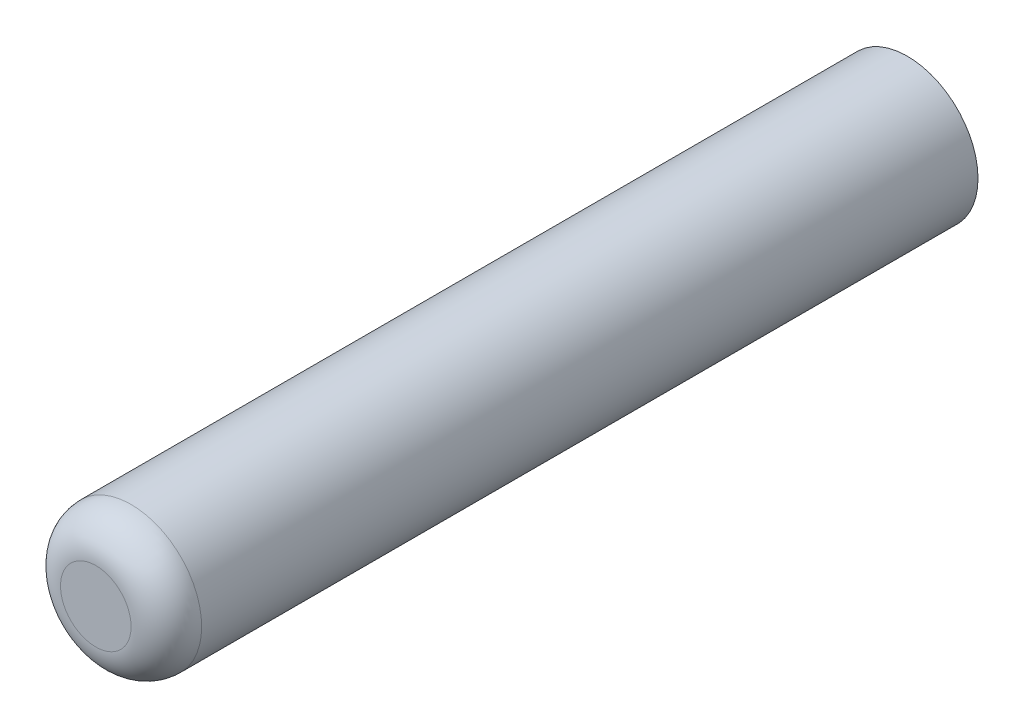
ISO-10303-21;
HEADER;
FILE_DESCRIPTION(('STEP AP214'),'2;1');
FILE_NAME('part.step','',(''),(''),'','','');
FILE_SCHEMA(('AUTOMOTIVE_DESIGN { 1 0 10303 214 1 1 1 1 }'));
ENDSEC;
DATA;
#1=APPLICATION_CONTEXT('core data for automotive mechanical design processes');
#2=APPLICATION_PROTOCOL_DEFINITION('international standard','automotive_design',2000,#1);
#3=PRODUCT_CONTEXT('',#1,'mechanical');
#4=PRODUCT('Part','Part','',(#3));
#5=PRODUCT_RELATED_PRODUCT_CATEGORY('part','',(#4));
#6=PRODUCT_DEFINITION_FORMATION('','',#4);
#7=PRODUCT_DEFINITION_CONTEXT('part definition',#1,'design');
#8=PRODUCT_DEFINITION('design','',#6,#7);
#9=PRODUCT_DEFINITION_SHAPE('','',#8);
#10=(LENGTH_UNIT() NAMED_UNIT(*) SI_UNIT(.MILLI.,.METRE.));
#11=(NAMED_UNIT(*) PLANE_ANGLE_UNIT() SI_UNIT($,.RADIAN.));
#12=(NAMED_UNIT(*) SI_UNIT($,.STERADIAN.) SOLID_ANGLE_UNIT());
#13=UNCERTAINTY_MEASURE_WITH_UNIT(LENGTH_MEASURE(1.E-05),#10,'distance_accuracy_value','');
#14=(GEOMETRIC_REPRESENTATION_CONTEXT(3) GLOBAL_UNCERTAINTY_ASSIGNED_CONTEXT((#13)) GLOBAL_UNIT_ASSIGNED_CONTEXT((#10,
#11,#12)) REPRESENTATION_CONTEXT('',''));
#15=CARTESIAN_POINT('',(0.,0.,0.));
#16=DIRECTION('',(0.,0.,1.));
#17=DIRECTION('',(1.,0.,0.));
#18=AXIS2_PLACEMENT_3D('',#15,#16,#17);
#19=CARTESIAN_POINT('',(0.,0.,5.75000000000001));
#20=DIRECTION('',(0.,0.,-1.));
#21=DIRECTION('',(-1.,0.,0.));
#22=AXIS2_PLACEMENT_3D('',#19,#20,#21);
#23=CYLINDRICAL_SURFACE('',#22,0.999999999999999);
#24=CARTESIAN_POINT('',(0.,0.,5.25));
#25=DIRECTION('',(0.,0.,1.));
#26=DIRECTION('',(1.,0.,0.));
#27=AXIS2_PLACEMENT_3D('',#24,#25,#26);
#28=CIRCLE('',#27,0.999999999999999);
#29=CARTESIAN_POINT('',(0.999999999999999,0.,5.25));
#30=VERTEX_POINT('',#29);
#31=EDGE_CURVE('E10',#30,#30,#28,.F.);
#32=ORIENTED_EDGE('',*,*,#31,.T.);
#33=EDGE_LOOP('',(#32));
#34=FACE_BOUND('',#33,.T.);
#35=CARTESIAN_POINT('',(0.,0.,-5.75000000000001));
#36=DIRECTION('',(0.,0.,1.));
#37=DIRECTION('',(1.,0.,0.));
#38=AXIS2_PLACEMENT_3D('',#35,#36,#37);
#39=CIRCLE('',#38,0.999999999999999);
#40=CARTESIAN_POINT('',(0.999999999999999,0.,-5.75000000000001));
#41=VERTEX_POINT('',#40);
#42=EDGE_CURVE('E39',#41,#41,#39,.T.);
#43=ORIENTED_EDGE('',*,*,#42,.T.);
#44=EDGE_LOOP('',(#43));
#45=FACE_BOUND('',#44,.T.);
#46=ADVANCED_FACE('F29',(#34,#45),#23,.T.);
#47=CARTESIAN_POINT('',(0.,0.,5.75000000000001));
#48=DIRECTION('',(0.,0.,1.));
#49=DIRECTION('',(1.,0.,0.));
#50=AXIS2_PLACEMENT_3D('',#47,#48,#49);
#51=PLANE('',#50);
#52=CARTESIAN_POINT('',(0.,0.,5.75000000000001));
#53=DIRECTION('',(0.,0.,1.));
#54=DIRECTION('',(1.,0.,0.));
#55=AXIS2_PLACEMENT_3D('',#52,#53,#54);
#56=CIRCLE('',#55,0.499999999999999);
#57=CARTESIAN_POINT('',(0.499999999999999,0.,5.75000000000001));
#58=VERTEX_POINT('',#57);
#59=EDGE_CURVE('E35',#58,#58,#56,.T.);
#60=ORIENTED_EDGE('',*,*,#59,.T.);
#61=EDGE_LOOP('',(#60));
#62=FACE_BOUND('',#61,.T.);
#63=ADVANCED_FACE('F50',(#62),#51,.T.);
#64=CARTESIAN_POINT('',(0.,0.,-5.75000000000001));
#65=DIRECTION('',(0.,0.,1.));
#66=DIRECTION('',(1.,0.,0.));
#67=AXIS2_PLACEMENT_3D('',#64,#65,#66);
#68=PLANE('',#67);
#69=ORIENTED_EDGE('',*,*,#42,.F.);
#70=EDGE_LOOP('',(#69));
#71=FACE_BOUND('',#70,.T.);
#72=ADVANCED_FACE('F47',(#71),#68,.F.);
#73=CARTESIAN_POINT('',(0.,0.,5.25));
#74=DIRECTION('',(0.,0.,1.));
#75=DIRECTION('',(1.,0.,0.));
#76=AXIS2_PLACEMENT_3D('',#73,#74,#75);
#77=DEGENERATE_TOROIDAL_SURFACE('',#76,0.499999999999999,0.5,.T.);
#78=ORIENTED_EDGE('',*,*,#31,.F.);
#79=EDGE_LOOP('',(#78));
#80=FACE_BOUND('',#79,.T.);
#81=ORIENTED_EDGE('',*,*,#59,.F.);
#82=EDGE_LOOP('',(#81));
#83=FACE_BOUND('',#82,.T.);
#84=ADVANCED_FACE('F49',(#80,#83),#77,.T.);
#85=CLOSED_SHELL('',(#46,#63,#72,#84));
#86=MANIFOLD_SOLID_BREP('B2',#85);
#87=ADVANCED_BREP_SHAPE_REPRESENTATION('',(#18,#86),#14);
#88=SHAPE_DEFINITION_REPRESENTATION(#9,#87);
ENDSEC;
END-ISO-10303-21;
